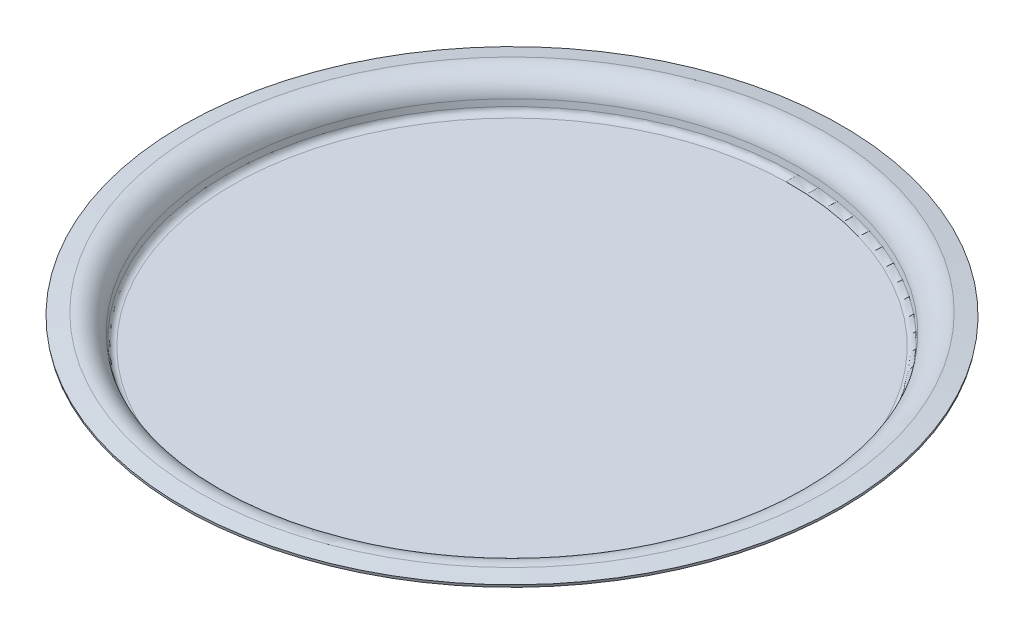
ISO-10303-21;
HEADER;
FILE_DESCRIPTION(('STEP AP214'),'2;1');
FILE_NAME('part.step','',(''),(''),'','','');
FILE_SCHEMA(('AUTOMOTIVE_DESIGN { 1 0 10303 214 1 1 1 1 }'));
ENDSEC;
DATA;
#1=APPLICATION_CONTEXT('core data for automotive mechanical design processes');
#2=APPLICATION_PROTOCOL_DEFINITION('international standard','automotive_design',2000,#1);
#3=PRODUCT_CONTEXT('',#1,'mechanical');
#4=PRODUCT('Part','Part','',(#3));
#5=PRODUCT_RELATED_PRODUCT_CATEGORY('part','',(#4));
#6=PRODUCT_DEFINITION_FORMATION('','',#4);
#7=PRODUCT_DEFINITION_CONTEXT('part definition',#1,'design');
#8=PRODUCT_DEFINITION('design','',#6,#7);
#9=PRODUCT_DEFINITION_SHAPE('','',#8);
#10=(LENGTH_UNIT() NAMED_UNIT(*) SI_UNIT(.MILLI.,.METRE.));
#11=(NAMED_UNIT(*) PLANE_ANGLE_UNIT() SI_UNIT($,.RADIAN.));
#12=(NAMED_UNIT(*) SI_UNIT($,.STERADIAN.) SOLID_ANGLE_UNIT());
#13=UNCERTAINTY_MEASURE_WITH_UNIT(LENGTH_MEASURE(1.E-05),#10,'distance_accuracy_value','');
#14=(GEOMETRIC_REPRESENTATION_CONTEXT(3) GLOBAL_UNCERTAINTY_ASSIGNED_CONTEXT((#13)) GLOBAL_UNIT_ASSIGNED_CONTEXT((#10,
#11,#12)) REPRESENTATION_CONTEXT('',''));
#15=CARTESIAN_POINT('',(0.,0.,0.));
#16=DIRECTION('',(0.,0.,1.));
#17=DIRECTION('',(1.,0.,0.));
#18=AXIS2_PLACEMENT_3D('',#15,#16,#17);
#19=CARTESIAN_POINT('',(0.,0.399999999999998,0.));
#20=DIRECTION('',(0.,-1.,0.));
#21=DIRECTION('',(1.,0.,0.));
#22=AXIS2_PLACEMENT_3D('',#19,#20,#21);
#23=PLANE('',#22);
#24=CARTESIAN_POINT('',(0.,0.399999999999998,0.));
#25=DIRECTION('',(0.,-1.,0.));
#26=DIRECTION('',(1.,0.,0.));
#27=AXIS2_PLACEMENT_3D('',#24,#25,#26);
#28=CIRCLE('',#27,42.8252605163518);
#29=CARTESIAN_POINT('',(42.8252605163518,0.400000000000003,0.));
#30=VERTEX_POINT('',#29);
#31=EDGE_CURVE('E50',#30,#30,#28,.F.);
#32=ORIENTED_EDGE('',*,*,#31,.T.);
#33=EDGE_LOOP('',(#32));
#34=FACE_BOUND('',#33,.T.);
#35=ADVANCED_FACE('F28',(#34),#23,.F.);
#36=CARTESIAN_POINT('',(0.,5.49999999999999,0.));
#37=DIRECTION('',(0.,1.,0.));
#38=DIRECTION('',(-1.,0.,0.));
#39=AXIS2_PLACEMENT_3D('',#36,#37,#38);
#40=CONICAL_SURFACE('',#39,44.5636277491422,0.174532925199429);
#41=CARTESIAN_POINT('',(0.,1.22635182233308,0.));
#42=DIRECTION('',(0.,1.,0.));
#43=DIRECTION('',(-1.,0.,0.));
#44=AXIS2_PLACEMENT_3D('',#41,#42,#43);
#45=CIRCLE('',#44,43.810068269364);
#46=CARTESIAN_POINT('',(-43.810068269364,1.22635182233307,0.));
#47=VERTEX_POINT('',#46);
#48=EDGE_CURVE('E47',#47,#47,#45,.F.);
#49=ORIENTED_EDGE('',*,*,#48,.T.);
#50=EDGE_LOOP('',(#49));
#51=FACE_BOUND('',#50,.T.);
#52=CARTESIAN_POINT('',(0.,2.1516536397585,0.));
#53=DIRECTION('',(0.,-1.,0.));
#54=DIRECTION('',(1.,0.,0.));
#55=AXIS2_PLACEMENT_3D('',#52,#53,#54);
#56=CIRCLE('',#55,43.9732239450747);
#57=CARTESIAN_POINT('',(43.9732239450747,2.1516536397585,0.));
#58=VERTEX_POINT('',#57);
#59=EDGE_CURVE('E56',#58,#58,#56,.F.);
#60=ORIENTED_EDGE('',*,*,#59,.T.);
#61=EDGE_LOOP('',(#60));
#62=FACE_BOUND('',#61,.T.);
#63=ADVANCED_FACE('F83',(#51,#62),#40,.F.);
#64=CARTESIAN_POINT('',(0.,4.45325740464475,0.));
#65=DIRECTION('',(0.,-1.,0.));
#66=DIRECTION('',(1.,0.,0.));
#67=AXIS2_PLACEMENT_3D('',#64,#65,#66);
#68=CONICAL_SURFACE('',#67,50.5,1.39626340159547);
#69=CARTESIAN_POINT('',(0.,4.90959619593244,0.));
#70=DIRECTION('',(0.,1.,0.));
#71=DIRECTION('',(-1.,0.,0.));
#72=AXIS2_PLACEMENT_3D('',#69,#70,#71);
#73=CIRCLE('',#72,47.9119741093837);
#74=CARTESIAN_POINT('',(-47.9119741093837,4.90959619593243,0.));
#75=VERTEX_POINT('',#74);
#76=EDGE_CURVE('E53',#75,#75,#73,.F.);
#77=ORIENTED_EDGE('',*,*,#76,.T.);
#78=EDGE_LOOP('',(#77));
#79=FACE_BOUND('',#78,.T.);
#80=CARTESIAN_POINT('',(0.,4.45325740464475,0.));
#81=DIRECTION('',(0.,1.,0.));
#82=DIRECTION('',(-1.,0.,0.));
#83=AXIS2_PLACEMENT_3D('',#80,#81,#82);
#84=CIRCLE('',#83,50.5);
#85=CARTESIAN_POINT('',(-50.5,4.45325740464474,0.));
#86=VERTEX_POINT('',#85);
#87=EDGE_CURVE('E59',#86,#86,#84,.T.);
#88=ORIENTED_EDGE('',*,*,#87,.T.);
#89=EDGE_LOOP('',(#88));
#90=FACE_BOUND('',#89,.T.);
#91=ADVANCED_FACE('F79',(#79,#90),#68,.T.);
#92=CARTESIAN_POINT('',(0.,4.05933430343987,0.));
#93=DIRECTION('',(0.,1.,0.));
#94=DIRECTION('',(-1.,0.,0.));
#95=AXIS2_PLACEMENT_3D('',#92,#93,#94);
#96=CONICAL_SURFACE('',#95,50.4305407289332,0.174532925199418);
#97=ORIENTED_EDGE('',*,*,#87,.F.);
#98=EDGE_LOOP('',(#97));
#99=FACE_BOUND('',#98,.T.);
#100=CARTESIAN_POINT('',(0.,4.05933430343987,0.));
#101=DIRECTION('',(0.,1.,0.));
#102=DIRECTION('',(-1.,0.,0.));
#103=AXIS2_PLACEMENT_3D('',#100,#101,#102);
#104=CIRCLE('',#103,50.4305407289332);
#105=CARTESIAN_POINT('',(-50.4305407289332,4.05933430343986,0.));
#106=VERTEX_POINT('',#105);
#107=EDGE_CURVE('E62',#106,#106,#104,.T.);
#108=ORIENTED_EDGE('',*,*,#107,.T.);
#109=EDGE_LOOP('',(#108));
#110=FACE_BOUND('',#109,.T.);
#111=ADVANCED_FACE('F66',(#99,#110),#96,.T.);
#112=CARTESIAN_POINT('',(0.,5.03661762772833,0.));
#113=DIRECTION('',(0.,-1.,0.));
#114=DIRECTION('',(1.,0.,0.));
#115=AXIS2_PLACEMENT_3D('',#112,#113,#114);
#116=CONICAL_SURFACE('',#115,44.8880915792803,1.39626340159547);
#117=CARTESIAN_POINT('',(0.,4.51567309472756,0.));
#118=DIRECTION('',(0.,-1.,0.));
#119=DIRECTION('',(1.,0.,0.));
#120=AXIS2_PLACEMENT_3D('',#117,#118,#119);
#121=CIRCLE('',#120,47.842514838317);
#122=CARTESIAN_POINT('',(47.842514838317,4.51567309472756,0.));
#123=VERTEX_POINT('',#122);
#124=EDGE_CURVE('E42',#123,#123,#121,.F.);
#125=ORIENTED_EDGE('',*,*,#124,.T.);
#126=EDGE_LOOP('',(#125));
#127=FACE_BOUND('',#126,.T.);
#128=ORIENTED_EDGE('',*,*,#107,.F.);
#129=EDGE_LOOP('',(#128));
#130=FACE_BOUND('',#129,.T.);
#131=ADVANCED_FACE('F68',(#127,#130),#116,.F.);
#132=CARTESIAN_POINT('',(0.,0.,0.));
#133=DIRECTION('',(0.,1.,0.));
#134=DIRECTION('',(-1.,0.,0.));
#135=AXIS2_PLACEMENT_3D('',#132,#133,#134);
#136=CONICAL_SURFACE('',#135,44.,0.174532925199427);
#137=CARTESIAN_POINT('',(0.,1.15689255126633,0.));
#138=DIRECTION('',(0.,-1.,0.));
#139=DIRECTION('',(1.,0.,0.));
#140=AXIS2_PLACEMENT_3D('',#137,#138,#139);
#141=CIRCLE('',#140,44.2039913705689);
#142=CARTESIAN_POINT('',(44.2039913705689,1.15689255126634,0.));
#143=VERTEX_POINT('',#142);
#144=EDGE_CURVE('E34',#143,#143,#141,.F.);
#145=ORIENTED_EDGE('',*,*,#144,.T.);
#146=EDGE_LOOP('',(#145));
#147=FACE_BOUND('',#146,.T.);
#148=CARTESIAN_POINT('',(0.,2.08219436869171,0.));
#149=DIRECTION('',(0.,1.,0.));
#150=DIRECTION('',(-1.,0.,0.));
#151=AXIS2_PLACEMENT_3D('',#148,#149,#150);
#152=CIRCLE('',#151,44.3671470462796);
#153=CARTESIAN_POINT('',(-44.3671470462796,2.08219436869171,0.));
#154=VERTEX_POINT('',#153);
#155=EDGE_CURVE('E38',#154,#154,#152,.F.);
#156=ORIENTED_EDGE('',*,*,#155,.T.);
#157=EDGE_LOOP('',(#156));
#158=FACE_BOUND('',#157,.T.);
#159=ADVANCED_FACE('F70',(#147,#158),#136,.T.);
#160=CARTESIAN_POINT('',(0.,0.,0.));
#161=DIRECTION('',(0.,1.,0.));
#162=DIRECTION('',(-1.,0.,0.));
#163=AXIS2_PLACEMENT_3D('',#160,#161,#162);
#164=PLANE('',#163);
#165=CARTESIAN_POINT('',(0.,0.,0.));
#166=DIRECTION('',(0.,1.,0.));
#167=DIRECTION('',(-1.,0.,0.));
#168=AXIS2_PLACEMENT_3D('',#165,#166,#167);
#169=CIRCLE('',#168,42.8252605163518);
#170=CARTESIAN_POINT('',(-42.8252605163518,0.,0.));
#171=VERTEX_POINT('',#170);
#172=EDGE_CURVE('E10',#171,#171,#169,.F.);
#173=ORIENTED_EDGE('',*,*,#172,.T.);
#174=EDGE_LOOP('',(#173));
#175=FACE_BOUND('',#174,.T.);
#176=ADVANCED_FACE('F77',(#175),#164,.F.);
#177=CARTESIAN_POINT('',(0.,1.56124983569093,0.));
#178=DIRECTION('',(0.,-1.,0.));
#179=DIRECTION('',(1.,0.,0.));
#180=AXIS2_PLACEMENT_3D('',#177,#178,#179);
#181=TOROIDAL_SURFACE('',#180,47.3215703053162,3.4);
#182=ORIENTED_EDGE('',*,*,#76,.F.);
#183=EDGE_LOOP('',(#182));
#184=FACE_BOUND('',#183,.T.);
#185=ORIENTED_EDGE('',*,*,#59,.F.);
#186=EDGE_LOOP('',(#185));
#187=FACE_BOUND('',#186,.T.);
#188=ADVANCED_FACE('F94',(#184,#187),#181,.T.);
#189=CARTESIAN_POINT('',(0.,1.4,0.));
#190=DIRECTION('',(0.,-1.,0.));
#191=DIRECTION('',(1.,0.,0.));
#192=AXIS2_PLACEMENT_3D('',#189,#190,#191);
#193=TOROIDAL_SURFACE('',#192,42.8252605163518,1.);
#194=ORIENTED_EDGE('',*,*,#48,.F.);
#195=EDGE_LOOP('',(#194));
#196=FACE_BOUND('',#195,.T.);
#197=ORIENTED_EDGE('',*,*,#31,.F.);
#198=EDGE_LOOP('',(#197));
#199=FACE_BOUND('',#198,.T.);
#200=ADVANCED_FACE('F91',(#196,#199),#193,.F.);
#201=CARTESIAN_POINT('',(0.,1.56124983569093,0.));
#202=DIRECTION('',(0.,1.,0.));
#203=DIRECTION('',(-1.,0.,0.));
#204=AXIS2_PLACEMENT_3D('',#201,#202,#203);
#205=TOROIDAL_SURFACE('',#204,47.3215703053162,3.);
#206=ORIENTED_EDGE('',*,*,#155,.F.);
#207=EDGE_LOOP('',(#206));
#208=FACE_BOUND('',#207,.T.);
#209=ORIENTED_EDGE('',*,*,#124,.F.);
#210=EDGE_LOOP('',(#209));
#211=FACE_BOUND('',#210,.T.);
#212=ADVANCED_FACE('F93',(#208,#211),#205,.F.);
#213=CARTESIAN_POINT('',(0.,1.4,0.));
#214=DIRECTION('',(0.,1.,0.));
#215=DIRECTION('',(-1.,0.,0.));
#216=AXIS2_PLACEMENT_3D('',#213,#214,#215);
#217=TOROIDAL_SURFACE('',#216,42.8252605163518,1.4);
#218=ORIENTED_EDGE('',*,*,#172,.F.);
#219=EDGE_LOOP('',(#218));
#220=FACE_BOUND('',#219,.T.);
#221=ORIENTED_EDGE('',*,*,#144,.F.);
#222=EDGE_LOOP('',(#221));
#223=FACE_BOUND('',#222,.T.);
#224=ADVANCED_FACE('F101',(#220,#223),#217,.T.);
#225=CLOSED_SHELL('',(#35,#63,#91,#111,#131,#159,#176,#188,#200,#212,#224));
#226=MANIFOLD_SOLID_BREP('B2',#225);
#227=ADVANCED_BREP_SHAPE_REPRESENTATION('',(#18,#226),#14);
#228=SHAPE_DEFINITION_REPRESENTATION(#9,#227);
ENDSEC;
END-ISO-10303-21;
